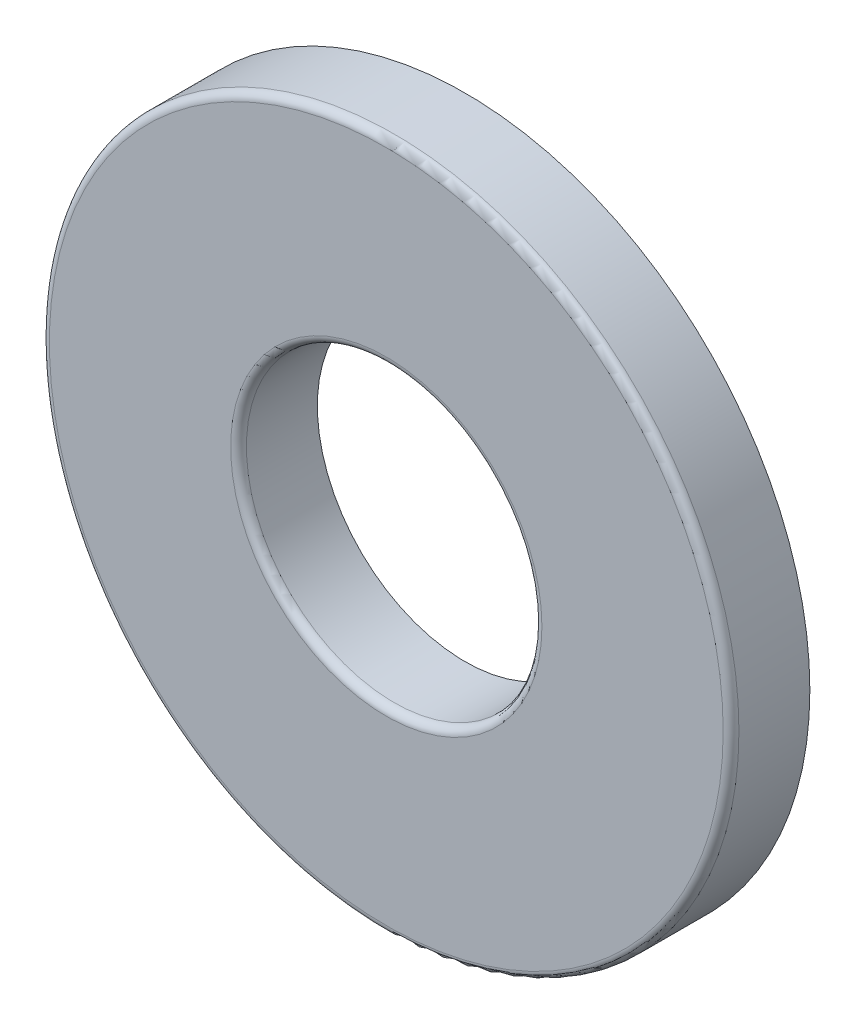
ISO-10303-21;
HEADER;
FILE_DESCRIPTION(('STEP AP214'),'2;1');
FILE_NAME('part.step','',(''),(''),'','','');
FILE_SCHEMA(('AUTOMOTIVE_DESIGN { 1 0 10303 214 1 1 1 1 }'));
ENDSEC;
DATA;
#1=APPLICATION_CONTEXT('core data for automotive mechanical design processes');
#2=APPLICATION_PROTOCOL_DEFINITION('international standard','automotive_design',2000,#1);
#3=PRODUCT_CONTEXT('',#1,'mechanical');
#4=PRODUCT('Part','Part','',(#3));
#5=PRODUCT_RELATED_PRODUCT_CATEGORY('part','',(#4));
#6=PRODUCT_DEFINITION_FORMATION('','',#4);
#7=PRODUCT_DEFINITION_CONTEXT('part definition',#1,'design');
#8=PRODUCT_DEFINITION('design','',#6,#7);
#9=PRODUCT_DEFINITION_SHAPE('','',#8);
#10=(LENGTH_UNIT() NAMED_UNIT(*) SI_UNIT(.MILLI.,.METRE.));
#11=(NAMED_UNIT(*) PLANE_ANGLE_UNIT() SI_UNIT($,.RADIAN.));
#12=(NAMED_UNIT(*) SI_UNIT($,.STERADIAN.) SOLID_ANGLE_UNIT());
#13=UNCERTAINTY_MEASURE_WITH_UNIT(LENGTH_MEASURE(1.E-05),#10,'distance_accuracy_value','');
#14=(GEOMETRIC_REPRESENTATION_CONTEXT(3) GLOBAL_UNCERTAINTY_ASSIGNED_CONTEXT((#13)) GLOBAL_UNIT_ASSIGNED_CONTEXT((#10,
#11,#12)) REPRESENTATION_CONTEXT('',''));
#15=CARTESIAN_POINT('',(0.,0.,0.));
#16=DIRECTION('',(0.,0.,1.));
#17=DIRECTION('',(1.,0.,0.));
#18=AXIS2_PLACEMENT_3D('',#15,#16,#17);
#19=CARTESIAN_POINT('',(0.,0.,-1.27));
#20=DIRECTION('',(0.,0.,1.));
#21=DIRECTION('',(1.,0.,0.));
#22=AXIS2_PLACEMENT_3D('',#19,#20,#21);
#23=CYLINDRICAL_SURFACE('',#22,11.1125);
#24=CARTESIAN_POINT('',(0.,0.,1.016));
#25=DIRECTION('',(0.,0.,1.));
#26=DIRECTION('',(1.,0.,0.));
#27=AXIS2_PLACEMENT_3D('',#24,#25,#26);
#28=CIRCLE('',#27,11.1125);
#29=CARTESIAN_POINT('',(11.1125,0.,1.016));
#30=VERTEX_POINT('',#29);
#31=EDGE_CURVE('E52',#30,#30,#28,.F.);
#32=ORIENTED_EDGE('',*,*,#31,.T.);
#33=EDGE_LOOP('',(#32));
#34=FACE_BOUND('',#33,.T.);
#35=CARTESIAN_POINT('',(0.,0.,-1.27));
#36=DIRECTION('',(0.,0.,1.));
#37=DIRECTION('',(1.,0.,0.));
#38=AXIS2_PLACEMENT_3D('',#35,#36,#37);
#39=CIRCLE('',#38,11.1125);
#40=CARTESIAN_POINT('',(11.1125,0.,-1.27));
#41=VERTEX_POINT('',#40);
#42=EDGE_CURVE('E70',#41,#41,#39,.T.);
#43=ORIENTED_EDGE('',*,*,#42,.T.);
#44=EDGE_LOOP('',(#43));
#45=FACE_BOUND('',#44,.T.);
#46=ADVANCED_FACE('F44',(#34,#45),#23,.T.);
#47=CARTESIAN_POINT('',(0.,0.,-1.27));
#48=DIRECTION('',(0.,0.,1.));
#49=DIRECTION('',(1.,0.,0.));
#50=AXIS2_PLACEMENT_3D('',#47,#48,#49);
#51=PLANE('',#50);
#52=CARTESIAN_POINT('',(0.,0.,-1.27));
#53=DIRECTION('',(0.,0.,1.));
#54=DIRECTION('',(1.,0.,0.));
#55=AXIS2_PLACEMENT_3D('',#52,#53,#54);
#56=CIRCLE('',#55,4.7625);
#57=CARTESIAN_POINT('',(4.7625,0.,-1.27));
#58=VERTEX_POINT('',#57);
#59=EDGE_CURVE('E74',#58,#58,#56,.T.);
#60=ORIENTED_EDGE('',*,*,#59,.T.);
#61=EDGE_LOOP('',(#60));
#62=FACE_BOUND('',#61,.T.);
#63=ORIENTED_EDGE('',*,*,#42,.F.);
#64=EDGE_LOOP('',(#63));
#65=FACE_BOUND('',#64,.T.);
#66=ADVANCED_FACE('F80',(#62,#65),#51,.F.);
#67=CARTESIAN_POINT('',(0.,0.,1.27));
#68=DIRECTION('',(0.,0.,1.));
#69=DIRECTION('',(1.,0.,0.));
#70=AXIS2_PLACEMENT_3D('',#67,#68,#69);
#71=PLANE('',#70);
#72=CARTESIAN_POINT('',(0.,0.,1.27));
#73=DIRECTION('',(0.,0.,1.));
#74=DIRECTION('',(1.,0.,0.));
#75=AXIS2_PLACEMENT_3D('',#72,#73,#74);
#76=CIRCLE('',#75,10.8585);
#77=CARTESIAN_POINT('',(10.8585,0.,1.27));
#78=VERTEX_POINT('',#77);
#79=EDGE_CURVE('E58',#78,#78,#76,.T.);
#80=ORIENTED_EDGE('',*,*,#79,.T.);
#81=EDGE_LOOP('',(#80));
#82=FACE_BOUND('',#81,.T.);
#83=CARTESIAN_POINT('',(0.,0.,1.27));
#84=DIRECTION('',(0.,0.,1.));
#85=DIRECTION('',(1.,0.,0.));
#86=AXIS2_PLACEMENT_3D('',#83,#84,#85);
#87=CIRCLE('',#86,5.0165);
#88=CARTESIAN_POINT('',(5.0165,0.,1.27));
#89=VERTEX_POINT('',#88);
#90=EDGE_CURVE('E64',#89,#89,#87,.F.);
#91=ORIENTED_EDGE('',*,*,#90,.T.);
#92=EDGE_LOOP('',(#91));
#93=FACE_BOUND('',#92,.T.);
#94=ADVANCED_FACE('F86',(#82,#93),#71,.T.);
#95=CARTESIAN_POINT('',(0.,0.,-1.27));
#96=DIRECTION('',(0.,0.,1.));
#97=DIRECTION('',(1.,0.,0.));
#98=AXIS2_PLACEMENT_3D('',#95,#96,#97);
#99=CYLINDRICAL_SURFACE('',#98,4.7625);
#100=CARTESIAN_POINT('',(0.,0.,1.016));
#101=DIRECTION('',(0.,0.,1.));
#102=DIRECTION('',(1.,0.,0.));
#103=AXIS2_PLACEMENT_3D('',#100,#101,#102);
#104=CIRCLE('',#103,4.7625);
#105=CARTESIAN_POINT('',(4.7625,0.,1.016));
#106=VERTEX_POINT('',#105);
#107=EDGE_CURVE('E10',#106,#106,#104,.T.);
#108=ORIENTED_EDGE('',*,*,#107,.T.);
#109=EDGE_LOOP('',(#108));
#110=FACE_BOUND('',#109,.T.);
#111=ORIENTED_EDGE('',*,*,#59,.F.);
#112=EDGE_LOOP('',(#111));
#113=FACE_BOUND('',#112,.T.);
#114=ADVANCED_FACE('F83',(#110,#113),#99,.F.);
#115=CARTESIAN_POINT('',(0.,0.,1.016));
#116=DIRECTION('',(0.,0.,1.));
#117=DIRECTION('',(1.,0.,0.));
#118=AXIS2_PLACEMENT_3D('',#115,#116,#117);
#119=TOROIDAL_SURFACE('',#118,10.8585,0.254);
#120=ORIENTED_EDGE('',*,*,#31,.F.);
#121=EDGE_LOOP('',(#120));
#122=FACE_BOUND('',#121,.T.);
#123=ORIENTED_EDGE('',*,*,#79,.F.);
#124=EDGE_LOOP('',(#123));
#125=FACE_BOUND('',#124,.T.);
#126=ADVANCED_FACE('F85',(#122,#125),#119,.T.);
#127=CARTESIAN_POINT('',(0.,0.,1.016));
#128=DIRECTION('',(0.,0.,1.));
#129=DIRECTION('',(1.,0.,0.));
#130=AXIS2_PLACEMENT_3D('',#127,#128,#129);
#131=TOROIDAL_SURFACE('',#130,5.0165,0.254);
#132=ORIENTED_EDGE('',*,*,#90,.F.);
#133=EDGE_LOOP('',(#132));
#134=FACE_BOUND('',#133,.T.);
#135=ORIENTED_EDGE('',*,*,#107,.F.);
#136=EDGE_LOOP('',(#135));
#137=FACE_BOUND('',#136,.T.);
#138=ADVANCED_FACE('F46',(#134,#137),#131,.T.);
#139=CLOSED_SHELL('',(#46,#66,#94,#114,#126,#138));
#140=MANIFOLD_SOLID_BREP('B2',#139);
#141=ADVANCED_BREP_SHAPE_REPRESENTATION('',(#18,#140),#14);
#142=SHAPE_DEFINITION_REPRESENTATION(#9,#141);
ENDSEC;
END-ISO-10303-21;
